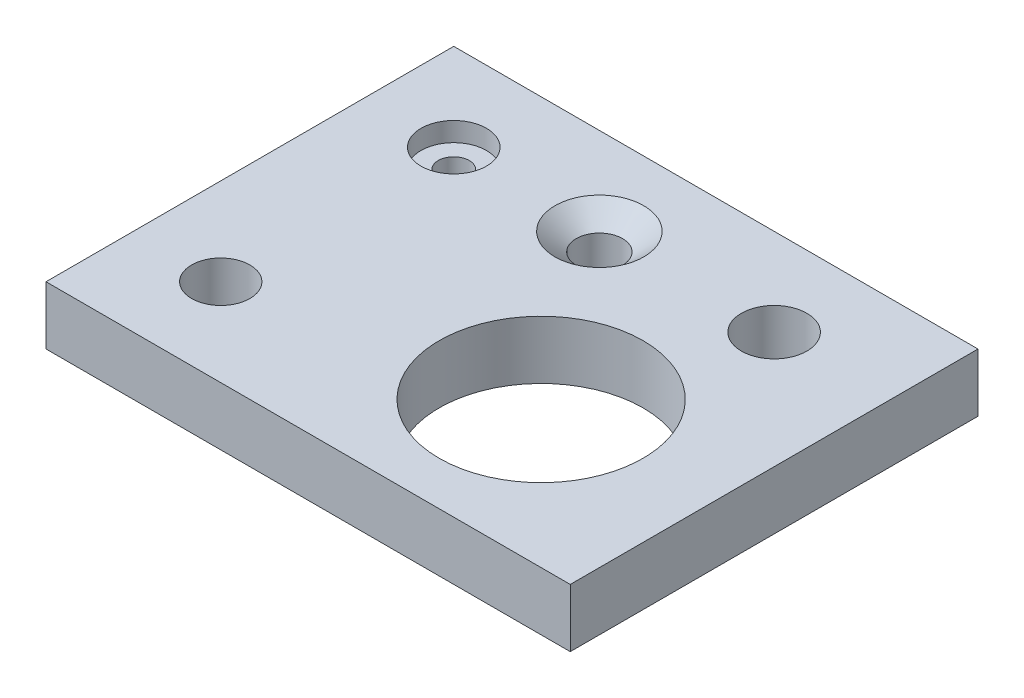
from build123d import *

# Parameters (mm, degrees)
SKETCH1_W                                            = 114.3
SKETCH1_H                                            = 88.9
EXTRUDE1_DEPTH                                       = 12.7
CBORE_FOR_1_4_BINDING_HEAD_MACHINE_SCREW_D           = 6.7564
CBORE_FOR_1_4_BINDING_HEAD_MACHINE_SCREW_CBORE_D     = 14.2875
CBORE_FOR_1_4_BINDING_HEAD_MACHINE_SCREW_CBORE_DEPTH = 4.191
CSK_FOR_3_8_FLAT_HEAD_MACHINE_SCREW_100_D            = 10.0838
CSK_FOR_3_8_FLAT_HEAD_MACHINE_SCREW_100_CSINK_D      = 19.3548
CSK_FOR_3_8_FLAT_HEAD_MACHINE_SCREW_100_CSINK_ANGLE  = 100
F_1_2_20_TAPPED_HOLE1_D                              = 11.50874
F_1_2_20_TAPPED_HOLE1_DEPTH                          = 29.21
F_1_2_20_TAPPED_HOLE1_CBORE_D                        = 12.7
F_1_2_20_TAPPED_HOLE1_CBORE_DEPTH                    = 25.4
F_1_2_20_TAPPED_HOLE1_TIP                            = 3.45757432
F_9_16_0_5625_DIAMETER_HOLE1_D                       = 14.2875
F_9_16_0_5625_DIAMETER_HOLE1_DEPTH                   = 25.4
F_9_16_0_5625_DIAMETER_HOLE1_TIP                     = 4.292398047
SKETCH9_R                                            = 22.225
LARGE_HOLE_CUT_DEPTH                                 = 74.506564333


with BuildPart() as part:
    # Sketch1 → Extrude1 (new body)
    with BuildSketch(Plane(origin=(0, 0, 0), x_dir=(1, 0, 0), z_dir=(0, 1, 0))):
        Rectangle(SKETCH1_W, SKETCH1_H)
    extrude(amount=EXTRUDE1_DEPTH)

    # CBORE for 1_4 Binding Head Machine Screw (through all)
    with Locations(Plane(origin=(0, 12.7, 0), x_dir=(-1, 0, 0), z_dir=(0, 1, 0))):
        with Locations((38.1, -25.4)):
            CounterBoreHole(CBORE_FOR_1_4_BINDING_HEAD_MACHINE_SCREW_D / 2, CBORE_FOR_1_4_BINDING_HEAD_MACHINE_SCREW_CBORE_D / 2, CBORE_FOR_1_4_BINDING_HEAD_MACHINE_SCREW_CBORE_DEPTH)

    # CSK for 3_8 Flat Head Machine Screw _100 (through all)
    with Locations(Plane(origin=(0, 12.7, 0), x_dir=(-1, 0, 0), z_dir=(0, 1, 0))):
        with Locations((6.35, -25.4)):
            CounterSinkHole(CSK_FOR_3_8_FLAT_HEAD_MACHINE_SCREW_100_D / 2, CSK_FOR_3_8_FLAT_HEAD_MACHINE_SCREW_100_CSINK_D / 2, counter_sink_angle=CSK_FOR_3_8_FLAT_HEAD_MACHINE_SCREW_100_CSINK_ANGLE)

    # 1_2-20 Tapped Hole1
    with Locations(Plane(origin=(0, 12.7, 0), x_dir=(-1, 0, 0), z_dir=(0, 1, 0))):
        with Locations((38.1, 25.4)):
            CounterBoreHole(F_1_2_20_TAPPED_HOLE1_D / 2, F_1_2_20_TAPPED_HOLE1_CBORE_D / 2, F_1_2_20_TAPPED_HOLE1_CBORE_DEPTH, depth=F_1_2_20_TAPPED_HOLE1_DEPTH)
            with Locations((0, 0, -(F_1_2_20_TAPPED_HOLE1_DEPTH + F_1_2_20_TAPPED_HOLE1_TIP / 2))):  # 118° drill point
                Cone(0, F_1_2_20_TAPPED_HOLE1_D / 2, F_1_2_20_TAPPED_HOLE1_TIP, mode=Mode.SUBTRACT)

    # 9_16 _0.5625_ Diameter Hole1
    with Locations(Plane(origin=(0, 12.7, 0), x_dir=(-1, 0, 0), z_dir=(0, 1, 0))):
        with Locations((-31.75, -25.4)):
            Hole(F_9_16_0_5625_DIAMETER_HOLE1_D / 2, depth=F_9_16_0_5625_DIAMETER_HOLE1_DEPTH)
            with Locations((0, 0, -(F_9_16_0_5625_DIAMETER_HOLE1_DEPTH + F_9_16_0_5625_DIAMETER_HOLE1_TIP / 2))):  # 118° drill point
                Cone(0, F_9_16_0_5625_DIAMETER_HOLE1_D / 2, F_9_16_0_5625_DIAMETER_HOLE1_TIP, mode=Mode.SUBTRACT)

    # Sketch9 → Large Hole Cut (cut, through all)
    with BuildSketch(Plane(origin=(0, 12.7, 0), x_dir=(-1, 0, 0), z_dir=(0, 1, 0))):
        with Locations(Location((-19.05, 12.7, 0), (0, 0, 90))):
            Circle(SKETCH9_R)
    extrude(amount=-LARGE_HOLE_CUT_DEPTH, mode=Mode.SUBTRACT)


solid = part.part
